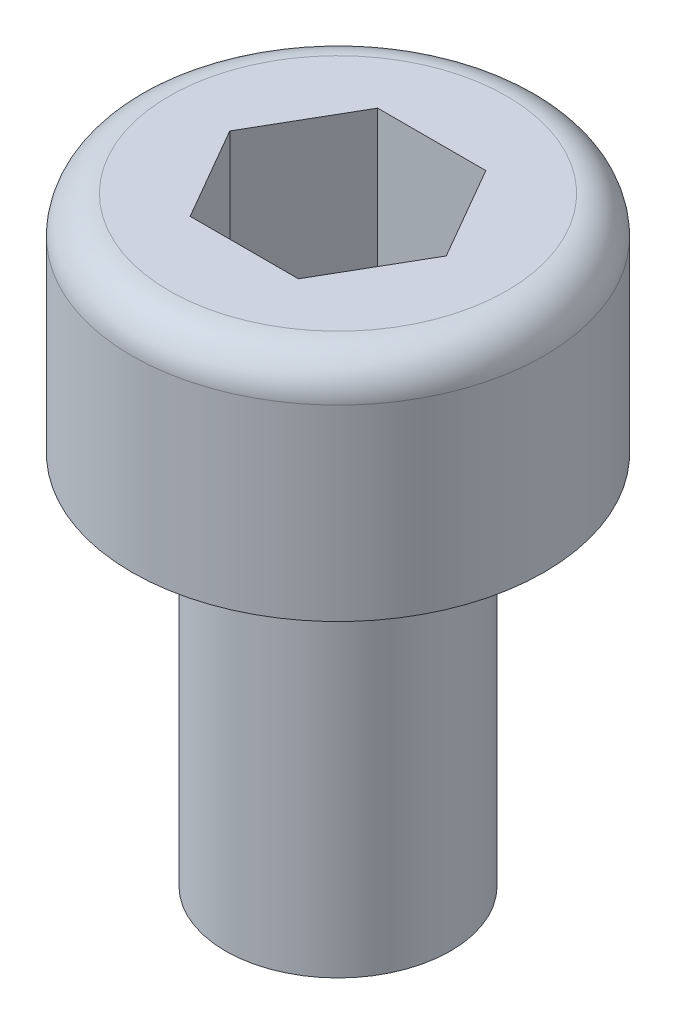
from build123d import *

# Parameters (mm, degrees)
CUT_EXTRUDE1_DEPTH = 2


with BuildPart() as part:
    # Sketch1 → Base-Revolve (revolve)
    with BuildSketch(Plane.XY):
        with BuildLine():
            Line((0, -5.401923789), (0, 3))
            Line((0, 3), (2.25, 3))
            ThreePointArc((2.25, 3), (2.603553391, 2.853553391), (2.75, 2.5))
            Line((2.75, 2.5), (2.75, 0))
            Line((2.75, 0), (1.5, 0))
            Line((1.5, 0), (1.5, -5))
            Line((1.5, -5), (0, -5.401923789))
        make_face()
    revolve(axis=Axis((0, 3, 0), (0, 1, 0)))

    # Sketch2 → Cut-Extrude1 (cut)
    with BuildSketch(Plane(origin=(0, 3, 0), x_dir=(-1, 0, 0), z_dir=(0, 1, 0))):
        Polygon((-1.443375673, 0), (-0.721687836, -1.25), (0.721687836, -1.25), (1.443375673, 0), (0.721687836, 1.25), (-0.721687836, 1.25), align=None)
    extrude(amount=-CUT_EXTRUDE1_DEPTH, mode=Mode.SUBTRACT)


solid = part.part
